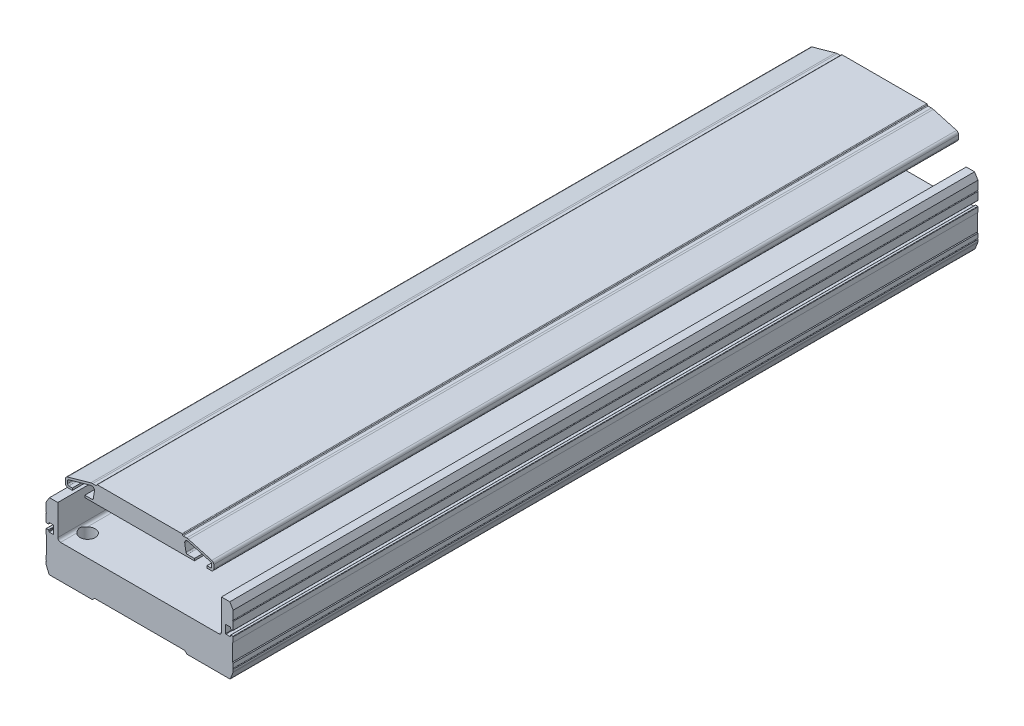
from build123d import *

# Parameters (mm, degrees)
EXTRUDE_1_DEPTH             = 537
EXTRUDE_1_2_DEPTH           = 537
HOLE_WIZARD_1_AT_2_COUNT    = 2
HOLE_WIZARD_1_AT_2_PITCH    = 106
HOLE_WIZARD_1_AT_3_COUNT    = 2
HOLE_WIZARD_1_AT_3_PITCH    = 117.200682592
HOLE_WIZARD_1_AT_4_COUNT    = 2
HOLE_WIZARD_1_AT_4_PITCH    = 50
HOLE_WIZARD_1_AT_5_COUNT    = 2
HOLE_WIZARD_1_AT_5_PITCH    = 271.543734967
HOLE_WIZARD_1_AT_6_COUNT    = 2
HOLE_WIZARD_1_AT_6_PITCH    = 250
HOLE_WIZARD_1_AT_7_COUNT    = 2
HOLE_WIZARD_1_AT_7_PITCH    = 462.315909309
HOLE_WIZARD_1_AT_8_COUNT    = 2
HOLE_WIZARD_1_AT_8_PITCH    = 450
HOLE_WIZARD_M6_0_AT_2_COUNT = 2
HOLE_WIZARD_M6_0_AT_2_PITCH = 106
HOLE_WIZARD_M6_0_AT_3_COUNT = 2
HOLE_WIZARD_M6_0_AT_3_PITCH = 50
HOLE_WIZARD_M6_0_AT_4_COUNT = 2
HOLE_WIZARD_M6_0_AT_4_PITCH = 117.200682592
HOLE_WIZARD_M6_0_AT_5_COUNT = 2
HOLE_WIZARD_M6_0_AT_5_PITCH = 271.543734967
HOLE_WIZARD_M6_0_AT_6_COUNT = 2
HOLE_WIZARD_M6_0_AT_6_PITCH = 250
HOLE_WIZARD_M6_0_AT_7_COUNT = 2
HOLE_WIZARD_M6_0_AT_7_PITCH = 462.315909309
HOLE_WIZARD_M6_0_AT_8_COUNT = 2
HOLE_WIZARD_M6_0_AT_8_PITCH = 450


with BuildPart() as part:
    # Sketch 1 → Extrude 1 (new body)
    with BuildSketch(Plane.XY):
        with BuildLine():
            Line((-39.5, 59.4), (39.5, 59.4))
            Line((39.5, 59.4), (39.5, 60.9))
            Line((39.5, 60.9), (34.4, 60.9))
            ThreePointArc((34.4, 60.9), (33.754110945, 61.136568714), (33.413816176, 61.734345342))
            Line((33.413816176, 61.734345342), (32.536146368, 66.959334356))
            ThreePointArc((32.536146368, 66.959334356), (33.171932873, 68.778444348), (35.048529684, 69.216359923))
            Line((35.048529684, 69.216359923), (51.270007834, 64.667479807))
            ThreePointArc((51.270007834, 64.667479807), (51.79687133, 64.308770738), (52, 63.704621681))
            Line((52, 63.704621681), (52, 61.9))
            ThreePointArc((52, 61.9), (51.707106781, 61.192893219), (51, 60.9))
            Line((51, 60.9), (48.5, 60.9))
            Line((48.5, 60.9), (48.5, 59.4))
            Line((48.5, 59.4), (51.5, 59.4))
            ThreePointArc((51.5, 59.4), (52.914213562, 59.985786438), (53.5, 61.4))
            Line((53.5, 61.4), (53.5, 64.083697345))
            ThreePointArc((53.5, 64.083697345), (53.093742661, 65.291995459), (52.040015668, 66.009413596))
            Line((52.040015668, 66.009413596), (35.262246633, 70.714290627))
            ThreePointArc((35.262246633, 70.714290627), (34.593583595, 70.853355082), (33.912207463, 70.9))
            Line((33.912207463, 70.9), (31.5, 70.9))
            ThreePointArc((31.5, 70.9), (31.146446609, 71.046446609), (31, 71.4))
            ThreePointArc((31, 71.4), (30.853553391, 71.753553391), (30.5, 71.9))
            Line((30.5, 71.9), (-30.5, 71.9))
            ThreePointArc((-30.5, 71.9), (-30.853553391, 71.753553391), (-31, 71.4))
            ThreePointArc((-31, 71.4), (-31.146446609, 71.046446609), (-31.5, 70.9))
            Line((-31.5, 70.9), (-33.912207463, 70.9))
            ThreePointArc((-33.912207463, 70.9), (-34.593583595, 70.853355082), (-35.262246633, 70.714290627))
            Line((-35.262246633, 70.714290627), (-52.040015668, 66.009413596))
            ThreePointArc((-52.040015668, 66.009413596), (-53.093742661, 65.291995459), (-53.5, 64.083697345))
            Line((-53.5, 64.083697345), (-53.5, 61.4))
            ThreePointArc((-53.5, 61.4), (-52.914213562, 59.985786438), (-51.5, 59.4))
            Line((-51.5, 59.4), (-48.5, 59.4))
            Line((-48.5, 59.4), (-48.5, 60.9))
            Line((-48.5, 60.9), (-51, 60.9))
            ThreePointArc((-51, 60.9), (-51.707106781, 61.192893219), (-52, 61.9))
            Line((-52, 61.9), (-52, 63.704621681))
            ThreePointArc((-52, 63.704621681), (-51.79687133, 64.308770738), (-51.270007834, 64.667479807))
            Line((-51.270007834, 64.667479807), (-35.048529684, 69.216359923))
            ThreePointArc((-35.048529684, 69.216359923), (-33.171932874, 68.778444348), (-32.536146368, 66.959334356))
            Line((-32.536146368, 66.959334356), (-33.413816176, 61.734345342))
            ThreePointArc((-33.413816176, 61.734345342), (-33.754110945, 61.136568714), (-34.4, 60.9))
            Line((-34.4, 60.9), (-39.5, 60.9))
            Line((-39.5, 60.9), (-39.5, 59.4))
        make_face()
    extrude(amount=-EXTRUDE_1_DEPTH)


with BuildPart() as body_2:
    # Sketch 1 → Extrude 1 2 (new body)
    with BuildSketch(Plane.XY):
        with BuildLine():
            Line((-67, 22), (-67, 10))
            Line((-67, 10), (-67.5, 9.5))
            Line((-67.5, 9.5), (-67.5, 6.375))
            ThreePointArc((-67.5, 6.375), (-67.125, 6), (-67.5, 5.625))
            Line((-67.5, 5.625), (-67.49999984, 4.381168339))
            ThreePointArc((-67.49999984, 4.381168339), (-67.464614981, 4.007418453), (-67.360006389, 3.646865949))
            Line((-67.360006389, 3.646865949), (-65.506419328, -1.028852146))
            ThreePointArc((-65.506419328, -1.028852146), (-65.35722349, -1.328991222), (-65.16, -1.6))
            Line((-65.16, -1.6), (-34.1, -1.6))
            Line((-34.1, -1.6), (-32.5, 0))
            Line((-32.5, 0), (32.5, 0))
            Line((32.5, 0), (34.1, -1.6))
            Line((34.1, -1.6), (65.16, -1.6))
            ThreePointArc((65.16, -1.6), (65.35722349, -1.328991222), (65.506419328, -1.028852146))
            Line((65.506419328, -1.028852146), (67.360006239, 3.646865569))
            ThreePointArc((67.360006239, 3.646865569), (67.464614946, 4.007418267), (67.499999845, 4.381168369))
            Line((67.499999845, 4.381168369), (67.499999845, 5.625000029))
            ThreePointArc((67.499999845, 5.625000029), (67.124999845, 6.000000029), (67.499999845, 6.375000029))
            Line((67.499999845, 6.375000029), (67.499999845, 9.500000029))
            Line((67.499999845, 9.500000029), (66.999999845, 10.000000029))
            Line((66.999999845, 10.000000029), (66.999999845, 22.000000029))
            Line((66.999999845, 22.000000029), (67.499999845, 22.500000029))
            Line((67.499999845, 22.500000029), (67.499999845, 25.900000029))
            ThreePointArc((67.499999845, 25.900000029), (67.41213188, 26.112132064), (67.199999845, 26.200000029))
            Line((67.199999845, 26.200000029), (65.799999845, 26.200000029))
            ThreePointArc((65.799999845, 26.200000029), (65.587867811, 26.112132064), (65.499999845, 25.900000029))
            Line((65.499999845, 25.900000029), (65.499999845, 25.300000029))
            ThreePointArc((65.499999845, 25.300000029), (65.41213188, 25.087867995), (65.199999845, 25.000000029))
            Line((65.199999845, 25.000000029), (62.299999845, 25.000000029))
            ThreePointArc((62.299999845, 25.000000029), (62.087867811, 25.087867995), (61.999999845, 25.300000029))
            Line((61.999999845, 25.300000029), (61.999999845, 30.700000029))
            ThreePointArc((61.999999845, 30.700000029), (62.087867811, 30.912132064), (62.299999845, 31.000000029))
            Line((62.299999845, 31.000000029), (65.199999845, 31.000000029))
            ThreePointArc((65.199999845, 31.000000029), (65.41213188, 30.912132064), (65.499999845, 30.700000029))
            Line((65.499999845, 30.700000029), (65.499999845, 30.100000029))
            ThreePointArc((65.499999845, 30.100000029), (65.587867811, 29.887867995), (65.799999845, 29.800000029))
            Line((65.799999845, 29.800000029), (67.199999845, 29.800000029))
            ThreePointArc((67.199999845, 29.800000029), (67.41213188, 29.887867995), (67.499999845, 30.100000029))
            Line((67.499999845, 30.100000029), (67.499999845, 35.625000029))
            ThreePointArc((67.499999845, 35.625000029), (67.124999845, 36.000000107), (67.5, 36.375000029))
            Line((67.5, 36.375000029), (67.5, 42.6))
            Line((67.5, 42.6), (65, 46.6))
            Line((65, 46.6), (59, 46.6))
            Line((59, 46.6), (59, 24.7))
            ThreePointArc((59, 24.7), (58.414213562, 23.285786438), (57, 22.7))
            Line((57, 22.7), (-57, 22.7))
            ThreePointArc((-57, 22.7), (-58.414213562, 23.285786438), (-59, 24.7))
            Line((-59, 24.7), (-59, 46.6))
            Line((-59, 46.6), (-65, 46.6))
            Line((-65, 46.6), (-67.5, 42.6))
            Line((-67.5, 42.6), (-67.5, 36.375))
            ThreePointArc((-67.5, 36.375), (-67.125, 36), (-67.5, 35.625))
            Line((-67.5, 35.625), (-67.5, 30.1))
            ThreePointArc((-67.5, 30.1), (-67.412132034, 29.887867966), (-67.2, 29.8))
            Line((-67.2, 29.8), (-65.8, 29.8))
            ThreePointArc((-65.8, 29.8), (-65.587867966, 29.887867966), (-65.5, 30.1))
            Line((-65.5, 30.1), (-65.5, 30.7))
            ThreePointArc((-65.5, 30.7), (-65.412132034, 30.912132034), (-65.2, 31))
            Line((-65.2, 31), (-62.3, 31))
            ThreePointArc((-62.3, 31), (-62.087867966, 30.912132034), (-62, 30.7))
            Line((-62, 30.7), (-62, 25.3))
            ThreePointArc((-62, 25.3), (-62.087867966, 25.087867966), (-62.3, 25))
            Line((-62.3, 25), (-65.2, 25))
            ThreePointArc((-65.2, 25), (-65.412132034, 25.087867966), (-65.5, 25.3))
            Line((-65.5, 25.3), (-65.5, 25.9))
            ThreePointArc((-65.5, 25.9), (-65.587867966, 26.112132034), (-65.8, 26.2))
            Line((-65.8, 26.2), (-67.2, 26.2))
            ThreePointArc((-67.2, 26.2), (-67.412132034, 26.112132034), (-67.5, 25.9))
            Line((-67.5, 25.9), (-67.5, 22.5))
            Line((-67.5, 22.5), (-67, 22))
        make_face()
    extrude(amount=-EXTRUDE_1_2_DEPTH)

    # Sketch 4 → Hole Wizard 1 (revolve, cut)
    with BuildSketch(Plane(origin=(-53, 46.6, -465.5), x_dir=(0, 0, 1), z_dir=(1, 0, 0))):
        Polygon((0, 0), (0, 48.2), (3.5, 48.2), (3.5, 41), (5.5, 41), (5.5, 0), align=None)
    hole_wizard_1 = revolve(axis=Axis((-53, 52.95, -465.5), (0, -1, 0)), mode=Mode.SUBTRACT)

    # Hole Wizard 1 at 2: Hole Wizard 1 ×2
    with Locations(*[(i * HOLE_WIZARD_1_AT_2_PITCH, 0, 0) for i in range(1, HOLE_WIZARD_1_AT_2_COUNT)]):
        add(hole_wizard_1, mode=Mode.SUBTRACT)

    # Hole Wizard 1 at 3: Hole Wizard 1 ×2
    with Locations(*[Vector(0.9044315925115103, 1.799157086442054e-13, 0.4266186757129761) * (i * HOLE_WIZARD_1_AT_3_PITCH) for i in range(1, HOLE_WIZARD_1_AT_3_COUNT)]):
        add(hole_wizard_1, mode=Mode.SUBTRACT)

    # Hole Wizard 1 at 4: Hole Wizard 1 ×2
    with Locations(*[(0, 0, i * HOLE_WIZARD_1_AT_4_PITCH) for i in range(1, HOLE_WIZARD_1_AT_4_COUNT)]):
        add(hole_wizard_1, mode=Mode.SUBTRACT)

    # Hole Wizard 1 at 5: Hole Wizard 1 ×2
    with Locations(*[Vector(0.3903606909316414, 7.765321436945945e-14, 0.9206620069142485) * (i * HOLE_WIZARD_1_AT_5_PITCH) for i in range(1, HOLE_WIZARD_1_AT_5_COUNT)]):
        add(hole_wizard_1, mode=Mode.SUBTRACT)

    # Hole Wizard 1 at 6: Hole Wizard 1 ×2
    with Locations(*[(0, 0, i * HOLE_WIZARD_1_AT_6_PITCH) for i in range(1, HOLE_WIZARD_1_AT_6_COUNT)]):
        add(hole_wizard_1, mode=Mode.SUBTRACT)

    # Hole Wizard 1 at 7: Hole Wizard 1 ×2
    with Locations(*[Vector(0.2292804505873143, 4.5610032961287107e-14, 0.9733604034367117) * (i * HOLE_WIZARD_1_AT_7_PITCH) for i in range(1, HOLE_WIZARD_1_AT_7_COUNT)]):
        add(hole_wizard_1, mode=Mode.SUBTRACT)

    # Hole Wizard 1 at 8: Hole Wizard 1 ×2
    with Locations(*[(0, 0, i * HOLE_WIZARD_1_AT_8_PITCH) for i in range(1, HOLE_WIZARD_1_AT_8_COUNT)]):
        add(hole_wizard_1, mode=Mode.SUBTRACT)

    # Sketch 6 → Hole Wizard M6 _0 (revolve, cut)
    with BuildSketch(Plane(origin=(-53, -1.6, -475.5), x_dir=(0, 0, -1), z_dir=(1, 0, 0))):
        Polygon((0, 0), (0, 16.502151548), (2.5, 15), (2.5, 0), align=None)
    hole_wizard_m6_0 = revolve(axis=Axis((-53, -7.95, -475.5), (0, 1, 0)), mode=Mode.SUBTRACT)

    # Hole Wizard M6 _0 at 2: Hole Wizard M6 _0 ×2
    with Locations(*[(i * HOLE_WIZARD_M6_0_AT_2_PITCH, 0, 0) for i in range(1, HOLE_WIZARD_M6_0_AT_2_COUNT)]):
        add(hole_wizard_m6_0, mode=Mode.SUBTRACT)

    # Hole Wizard M6 _0 at 3: Hole Wizard M6 _0 ×2
    with Locations(*[(0, 0, i * HOLE_WIZARD_M6_0_AT_3_PITCH) for i in range(1, HOLE_WIZARD_M6_0_AT_3_COUNT)]):
        add(hole_wizard_m6_0, mode=Mode.SUBTRACT)

    # Hole Wizard M6 _0 at 4: Hole Wizard M6 _0 ×2
    with Locations(*[Vector(0.9044315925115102, 0, 0.4266186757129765) * (i * HOLE_WIZARD_M6_0_AT_4_PITCH) for i in range(1, HOLE_WIZARD_M6_0_AT_4_COUNT)]):
        add(hole_wizard_m6_0, mode=Mode.SUBTRACT)

    # Hole Wizard M6 _0 at 5: Hole Wizard M6 _0 ×2
    with Locations(*[Vector(0.39036069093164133, 0, 0.9206620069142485) * (i * HOLE_WIZARD_M6_0_AT_5_PITCH) for i in range(1, HOLE_WIZARD_M6_0_AT_5_COUNT)]):
        add(hole_wizard_m6_0, mode=Mode.SUBTRACT)

    # Hole Wizard M6 _0 at 6: Hole Wizard M6 _0 ×2
    with Locations(*[(0, 0, i * HOLE_WIZARD_M6_0_AT_6_PITCH) for i in range(1, HOLE_WIZARD_M6_0_AT_6_COUNT)]):
        add(hole_wizard_m6_0, mode=Mode.SUBTRACT)

    # Hole Wizard M6 _0 at 7: Hole Wizard M6 _0 ×2
    with Locations(*[Vector(0.2292804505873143, 0, 0.9733604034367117) * (i * HOLE_WIZARD_M6_0_AT_7_PITCH) for i in range(1, HOLE_WIZARD_M6_0_AT_7_COUNT)]):
        add(hole_wizard_m6_0, mode=Mode.SUBTRACT)

    # Hole Wizard M6 _0 at 8: Hole Wizard M6 _0 ×2
    with Locations(*[(0, 0, i * HOLE_WIZARD_M6_0_AT_8_PITCH) for i in range(1, HOLE_WIZARD_M6_0_AT_8_COUNT)]):
        add(hole_wizard_m6_0, mode=Mode.SUBTRACT)


solid = Compound([part.part, body_2.part])
